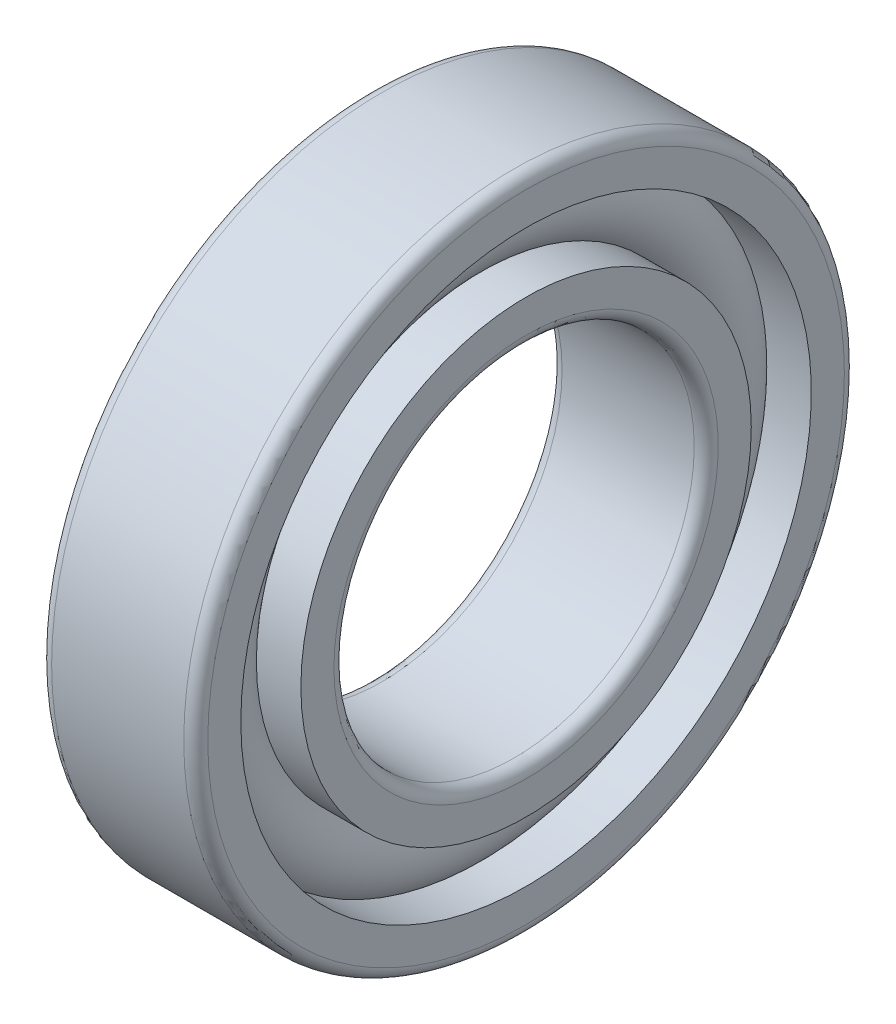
ISO-10303-21;
HEADER;
FILE_DESCRIPTION(('STEP AP214'),'2;1');
FILE_NAME('part.step','',(''),(''),'','','');
FILE_SCHEMA(('AUTOMOTIVE_DESIGN { 1 0 10303 214 1 1 1 1 }'));
ENDSEC;
DATA;
#1=APPLICATION_CONTEXT('core data for automotive mechanical design processes');
#2=APPLICATION_PROTOCOL_DEFINITION('international standard','automotive_design',2000,#1);
#3=PRODUCT_CONTEXT('',#1,'mechanical');
#4=PRODUCT('Part','Part','',(#3));
#5=PRODUCT_RELATED_PRODUCT_CATEGORY('part','',(#4));
#6=PRODUCT_DEFINITION_FORMATION('','',#4);
#7=PRODUCT_DEFINITION_CONTEXT('part definition',#1,'design');
#8=PRODUCT_DEFINITION('design','',#6,#7);
#9=PRODUCT_DEFINITION_SHAPE('','',#8);
#10=(LENGTH_UNIT() NAMED_UNIT(*) SI_UNIT(.MILLI.,.METRE.));
#11=(NAMED_UNIT(*) PLANE_ANGLE_UNIT() SI_UNIT($,.RADIAN.));
#12=(NAMED_UNIT(*) SI_UNIT($,.STERADIAN.) SOLID_ANGLE_UNIT());
#13=UNCERTAINTY_MEASURE_WITH_UNIT(LENGTH_MEASURE(1.E-05),#10,'distance_accuracy_value','');
#14=(GEOMETRIC_REPRESENTATION_CONTEXT(3) GLOBAL_UNCERTAINTY_ASSIGNED_CONTEXT((#13)) GLOBAL_UNIT_ASSIGNED_CONTEXT((#10,
#11,#12)) REPRESENTATION_CONTEXT('',''));
#15=CARTESIAN_POINT('',(0.,0.,0.));
#16=DIRECTION('',(0.,0.,1.));
#17=DIRECTION('',(1.,0.,0.));
#18=AXIS2_PLACEMENT_3D('',#15,#16,#17);
#19=CARTESIAN_POINT('',(6.5,0.,0.));
#20=DIRECTION('',(-1.,0.,0.));
#21=DIRECTION('',(0.,0.,1.));
#22=AXIS2_PLACEMENT_3D('',#19,#20,#21);
#23=TOROIDAL_SURFACE('',#22,21.25,3.75);
#24=CARTESIAN_POINT('',(6.5,0.,25.));
#25=VERTEX_POINT('',#24);
#26=VERTEX_LOOP('',#25);
#27=FACE_BOUND('',#26,.T.);
#28=ADVANCED_FACE('P0_F36',(#27),#23,.T.);
#29=CLOSED_SHELL('',(#28));
#30=CARTESIAN_POINT('',(6.5,0.,0.));
#31=DIRECTION('',(-1.,0.,0.));
#32=DIRECTION('',(0.,0.,1.));
#33=AXIS2_PLACEMENT_3D('',#30,#31,#32);
#34=TOROIDAL_SURFACE('',#33,21.25,3.7);
#35=CARTESIAN_POINT('',(6.5,0.,24.95));
#36=VERTEX_POINT('',#35);
#37=VERTEX_LOOP('',#36);
#38=FACE_BOUND('',#37,.T.);
#39=ADVANCED_FACE('P0_F49',(#38),#34,.F.);
#40=CLOSED_SHELL('',(#39));
#41=ORIENTED_CLOSED_SHELL('',*,#40,.T.);
#42=BREP_WITH_VOIDS('P0_B2',#29,(#41));
#43=CARTESIAN_POINT('',(0.499999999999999,23.65,0.));
#44=DIRECTION('',(1.,0.,0.));
#45=DIRECTION('',(0.,0.,-1.));
#46=AXIS2_PLACEMENT_3D('',#43,#44,#45);
#47=PLANE('',#46);
#48=CARTESIAN_POINT('',(0.499999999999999,0.,0.));
#49=DIRECTION('',(-1.,0.,0.));
#50=DIRECTION('',(0.,0.,1.));
#51=AXIS2_PLACEMENT_3D('',#48,#49,#50);
#52=CIRCLE('',#51,18.85);
#53=CARTESIAN_POINT('',(0.499999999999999,0.,18.85));
#54=VERTEX_POINT('',#53);
#55=EDGE_CURVE('P0_E34',#54,#54,#52,.T.);
#56=ORIENTED_EDGE('',*,*,#55,.F.);
#57=EDGE_LOOP('',(#56));
#58=FACE_BOUND('',#57,.T.);
#59=CARTESIAN_POINT('',(0.499999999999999,0.,0.));
#60=DIRECTION('',(-1.,0.,0.));
#61=DIRECTION('',(0.,0.,1.));
#62=AXIS2_PLACEMENT_3D('',#59,#60,#61);
#63=CIRCLE('',#62,23.65);
#64=CARTESIAN_POINT('',(0.499999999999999,0.,23.65));
#65=VERTEX_POINT('',#64);
#66=EDGE_CURVE('P0_E80',#65,#65,#63,.T.);
#67=ORIENTED_EDGE('',*,*,#66,.T.);
#68=EDGE_LOOP('',(#67));
#69=FACE_BOUND('',#68,.T.);
#70=ADVANCED_FACE('P0_F66',(#58,#69),#47,.F.);
#71=CARTESIAN_POINT('',(0.,0.,0.));
#72=DIRECTION('',(-1.,0.,0.));
#73=DIRECTION('',(0.,0.,1.));
#74=AXIS2_PLACEMENT_3D('',#71,#72,#73);
#75=CYLINDRICAL_SURFACE('',#74,18.85);
#76=CARTESIAN_POINT('',(0.699999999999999,0.,0.));
#77=DIRECTION('',(-1.,0.,0.));
#78=DIRECTION('',(0.,0.,1.));
#79=AXIS2_PLACEMENT_3D('',#76,#77,#78);
#80=CIRCLE('',#79,18.85);
#81=CARTESIAN_POINT('',(0.699999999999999,0.,18.85));
#82=VERTEX_POINT('',#81);
#83=EDGE_CURVE('P0_E72',#82,#82,#80,.T.);
#84=ORIENTED_EDGE('',*,*,#83,.F.);
#85=EDGE_LOOP('',(#84));
#86=FACE_BOUND('',#85,.T.);
#87=ORIENTED_EDGE('',*,*,#55,.T.);
#88=EDGE_LOOP('',(#87));
#89=FACE_BOUND('',#88,.T.);
#90=ADVANCED_FACE('P0_F95',(#86,#89),#75,.F.);
#91=CARTESIAN_POINT('',(0.699999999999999,23.65,0.));
#92=DIRECTION('',(-1.,0.,0.));
#93=DIRECTION('',(0.,0.,1.));
#94=AXIS2_PLACEMENT_3D('',#91,#92,#93);
#95=PLANE('',#94);
#96=CARTESIAN_POINT('',(0.699999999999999,0.,0.));
#97=DIRECTION('',(-1.,0.,0.));
#98=DIRECTION('',(0.,0.,1.));
#99=AXIS2_PLACEMENT_3D('',#96,#97,#98);
#100=CIRCLE('',#99,23.65);
#101=CARTESIAN_POINT('',(0.699999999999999,0.,23.65));
#102=VERTEX_POINT('',#101);
#103=EDGE_CURVE('P0_E76',#102,#102,#100,.T.);
#104=ORIENTED_EDGE('',*,*,#103,.F.);
#105=EDGE_LOOP('',(#104));
#106=FACE_BOUND('',#105,.T.);
#107=ORIENTED_EDGE('',*,*,#83,.T.);
#108=EDGE_LOOP('',(#107));
#109=FACE_BOUND('',#108,.T.);
#110=ADVANCED_FACE('P0_F90',(#106,#109),#95,.F.);
#111=CARTESIAN_POINT('',(0.,0.,0.));
#112=DIRECTION('',(-1.,0.,0.));
#113=DIRECTION('',(0.,0.,1.));
#114=AXIS2_PLACEMENT_3D('',#111,#112,#113);
#115=CYLINDRICAL_SURFACE('',#114,23.65);
#116=ORIENTED_EDGE('',*,*,#66,.F.);
#117=EDGE_LOOP('',(#116));
#118=FACE_BOUND('',#117,.T.);
#119=ORIENTED_EDGE('',*,*,#103,.T.);
#120=EDGE_LOOP('',(#119));
#121=FACE_BOUND('',#120,.T.);
#122=ADVANCED_FACE('P0_F87',(#118,#121),#115,.T.);
#123=CLOSED_SHELL('',(#70,#90,#110,#122));
#124=MANIFOLD_SOLID_BREP('P0_B6',#123);
#125=CARTESIAN_POINT('',(1.,0.,0.));
#126=DIRECTION('',(-1.,0.,0.));
#127=DIRECTION('',(0.,0.,1.));
#128=AXIS2_PLACEMENT_3D('',#125,#126,#127);
#129=TOROIDAL_SURFACE('',#128,16.,1.);
#130=CARTESIAN_POINT('',(1.,0.,0.));
#131=DIRECTION('',(-1.,0.,0.));
#132=DIRECTION('',(0.,0.,1.));
#133=AXIS2_PLACEMENT_3D('',#130,#131,#132);
#134=CIRCLE('',#133,15.);
#135=CARTESIAN_POINT('',(1.,0.,15.));
#136=VERTEX_POINT('',#135);
#137=EDGE_CURVE('P0_E65',#136,#136,#134,.T.);
#138=ORIENTED_EDGE('',*,*,#137,.F.);
#139=EDGE_LOOP('',(#138));
#140=FACE_BOUND('',#139,.T.);
#141=CARTESIAN_POINT('',(0.,0.,0.));
#142=DIRECTION('',(-1.,0.,0.));
#143=DIRECTION('',(0.,0.,1.));
#144=AXIS2_PLACEMENT_3D('',#141,#142,#143);
#145=CIRCLE('',#144,16.);
#146=CARTESIAN_POINT('',(0.,0.,16.));
#147=VERTEX_POINT('',#146);
#148=EDGE_CURVE('P0_E155',#147,#147,#145,.T.);
#149=ORIENTED_EDGE('',*,*,#148,.T.);
#150=EDGE_LOOP('',(#149));
#151=FACE_BOUND('',#150,.T.);
#152=ADVANCED_FACE('P0_F127',(#140,#151),#129,.T.);
#153=CARTESIAN_POINT('',(0.,0.,0.));
#154=DIRECTION('',(-1.,0.,0.));
#155=DIRECTION('',(0.,0.,1.));
#156=AXIS2_PLACEMENT_3D('',#153,#154,#155);
#157=CYLINDRICAL_SURFACE('',#156,15.);
#158=CARTESIAN_POINT('',(12.,0.,0.));
#159=DIRECTION('',(-1.,0.,0.));
#160=DIRECTION('',(0.,0.,1.));
#161=AXIS2_PLACEMENT_3D('',#158,#159,#160);
#162=CIRCLE('',#161,15.);
#163=CARTESIAN_POINT('',(12.,0.,15.));
#164=VERTEX_POINT('',#163);
#165=EDGE_CURVE('P0_E133',#164,#164,#162,.T.);
#166=ORIENTED_EDGE('',*,*,#165,.F.);
#167=EDGE_LOOP('',(#166));
#168=FACE_BOUND('',#167,.T.);
#169=ORIENTED_EDGE('',*,*,#137,.T.);
#170=EDGE_LOOP('',(#169));
#171=FACE_BOUND('',#170,.T.);
#172=ADVANCED_FACE('P0_F192',(#168,#171),#157,.F.);
#173=CARTESIAN_POINT('',(12.,0.,0.));
#174=DIRECTION('',(-1.,0.,0.));
#175=DIRECTION('',(0.,0.,1.));
#176=AXIS2_PLACEMENT_3D('',#173,#174,#175);
#177=TOROIDAL_SURFACE('',#176,16.,1.);
#178=CARTESIAN_POINT('',(13.,0.,0.));
#179=DIRECTION('',(-1.,0.,0.));
#180=DIRECTION('',(0.,0.,1.));
#181=AXIS2_PLACEMENT_3D('',#178,#179,#180);
#182=CIRCLE('',#181,16.);
#183=CARTESIAN_POINT('',(13.,0.,16.));
#184=VERTEX_POINT('',#183);
#185=EDGE_CURVE('P0_E137',#184,#184,#182,.T.);
#186=ORIENTED_EDGE('',*,*,#185,.F.);
#187=EDGE_LOOP('',(#186));
#188=FACE_BOUND('',#187,.T.);
#189=ORIENTED_EDGE('',*,*,#165,.T.);
#190=EDGE_LOOP('',(#189));
#191=FACE_BOUND('',#190,.T.);
#192=ADVANCED_FACE('P0_F187',(#188,#191),#177,.T.);
#193=CARTESIAN_POINT('',(13.,0.,-18.75));
#194=DIRECTION('',(-1.,0.,0.));
#195=DIRECTION('',(0.,0.,1.));
#196=AXIS2_PLACEMENT_3D('',#193,#194,#195);
#197=PLANE('',#196);
#198=CARTESIAN_POINT('',(13.,0.,0.));
#199=DIRECTION('',(-1.,0.,0.));
#200=DIRECTION('',(0.,0.,1.));
#201=AXIS2_PLACEMENT_3D('',#198,#199,#200);
#202=CIRCLE('',#201,18.75);
#203=CARTESIAN_POINT('',(13.,0.,18.75));
#204=VERTEX_POINT('',#203);
#205=EDGE_CURVE('P0_E141',#204,#204,#202,.T.);
#206=ORIENTED_EDGE('',*,*,#205,.F.);
#207=EDGE_LOOP('',(#206));
#208=FACE_BOUND('',#207,.T.);
#209=ORIENTED_EDGE('',*,*,#185,.T.);
#210=EDGE_LOOP('',(#209));
#211=FACE_BOUND('',#210,.T.);
#212=ADVANCED_FACE('P0_F181',(#208,#211),#197,.F.);
#213=CARTESIAN_POINT('',(0.,0.,0.));
#214=DIRECTION('',(-1.,0.,0.));
#215=DIRECTION('',(0.,0.,1.));
#216=AXIS2_PLACEMENT_3D('',#213,#214,#215);
#217=CYLINDRICAL_SURFACE('',#216,18.75);
#218=CARTESIAN_POINT('',(9.29508497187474,0.,0.));
#219=DIRECTION('',(-1.,0.,0.));
#220=DIRECTION('',(0.,0.,1.));
#221=AXIS2_PLACEMENT_3D('',#218,#219,#220);
#222=CIRCLE('',#221,18.75);
#223=CARTESIAN_POINT('',(9.29508497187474,0.,18.75));
#224=VERTEX_POINT('',#223);
#225=EDGE_CURVE('P0_E146',#224,#224,#222,.T.);
#226=ORIENTED_EDGE('',*,*,#225,.F.);
#227=EDGE_LOOP('',(#226));
#228=FACE_BOUND('',#227,.T.);
#229=ORIENTED_EDGE('',*,*,#205,.T.);
#230=EDGE_LOOP('',(#229));
#231=FACE_BOUND('',#230,.T.);
#232=ADVANCED_FACE('P0_F175',(#228,#231),#217,.T.);
#233=CARTESIAN_POINT('',(6.5,0.,0.));
#234=DIRECTION('',(-1.,0.,0.));
#235=DIRECTION('',(0.,0.,1.));
#236=AXIS2_PLACEMENT_3D('',#233,#234,#235);
#237=TOROIDAL_SURFACE('',#236,21.25,3.75);
#238=CARTESIAN_POINT('',(3.70491502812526,0.,0.));
#239=DIRECTION('',(-1.,0.,0.));
#240=DIRECTION('',(0.,0.,1.));
#241=AXIS2_PLACEMENT_3D('',#238,#239,#240);
#242=CIRCLE('',#241,18.75);
#243=CARTESIAN_POINT('',(3.70491502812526,0.,18.75));
#244=VERTEX_POINT('',#243);
#245=EDGE_CURVE('P0_E149',#244,#244,#242,.T.);
#246=ORIENTED_EDGE('',*,*,#245,.F.);
#247=EDGE_LOOP('',(#246));
#248=FACE_BOUND('',#247,.T.);
#249=ORIENTED_EDGE('',*,*,#225,.T.);
#250=EDGE_LOOP('',(#249));
#251=FACE_BOUND('',#250,.T.);
#252=ADVANCED_FACE('P0_F169',(#248,#251),#237,.F.);
#253=CARTESIAN_POINT('',(0.,0.,0.));
#254=DIRECTION('',(-1.,0.,0.));
#255=DIRECTION('',(0.,0.,1.));
#256=AXIS2_PLACEMENT_3D('',#253,#254,#255);
#257=CYLINDRICAL_SURFACE('',#256,18.75);
#258=CARTESIAN_POINT('',(0.,0.,0.));
#259=DIRECTION('',(-1.,0.,0.));
#260=DIRECTION('',(0.,0.,1.));
#261=AXIS2_PLACEMENT_3D('',#258,#259,#260);
#262=CIRCLE('',#261,18.75);
#263=CARTESIAN_POINT('',(0.,0.,18.75));
#264=VERTEX_POINT('',#263);
#265=EDGE_CURVE('P0_E152',#264,#264,#262,.T.);
#266=ORIENTED_EDGE('',*,*,#265,.F.);
#267=EDGE_LOOP('',(#266));
#268=FACE_BOUND('',#267,.T.);
#269=ORIENTED_EDGE('',*,*,#245,.T.);
#270=EDGE_LOOP('',(#269));
#271=FACE_BOUND('',#270,.T.);
#272=ADVANCED_FACE('P0_F163',(#268,#271),#257,.T.);
#273=CARTESIAN_POINT('',(0.,0.,-18.75));
#274=DIRECTION('',(1.,0.,0.));
#275=DIRECTION('',(0.,0.,-1.));
#276=AXIS2_PLACEMENT_3D('',#273,#274,#275);
#277=PLANE('',#276);
#278=ORIENTED_EDGE('',*,*,#148,.F.);
#279=EDGE_LOOP('',(#278));
#280=FACE_BOUND('',#279,.T.);
#281=ORIENTED_EDGE('',*,*,#265,.T.);
#282=EDGE_LOOP('',(#281));
#283=FACE_BOUND('',#282,.T.);
#284=ADVANCED_FACE('P0_F160',(#280,#283),#277,.F.);
#285=CLOSED_SHELL('',(#152,#172,#192,#212,#232,#252,#272,#284));
#286=MANIFOLD_SOLID_BREP('P0_B29',#285);
#287=CARTESIAN_POINT('',(0.999999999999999,0.,0.));
#288=DIRECTION('',(-1.,0.,0.));
#289=DIRECTION('',(0.,0.,1.));
#290=AXIS2_PLACEMENT_3D('',#287,#288,#289);
#291=TOROIDAL_SURFACE('',#290,26.5,1.);
#292=CARTESIAN_POINT('',(0.,0.,0.));
#293=DIRECTION('',(-1.,0.,0.));
#294=DIRECTION('',(0.,0.,1.));
#295=AXIS2_PLACEMENT_3D('',#292,#293,#294);
#296=CIRCLE('',#295,26.5);
#297=CARTESIAN_POINT('',(0.,0.,26.5));
#298=VERTEX_POINT('',#297);
#299=EDGE_CURVE('P1_E10',#298,#298,#296,.T.);
#300=ORIENTED_EDGE('',*,*,#299,.F.);
#301=EDGE_LOOP('',(#300));
#302=FACE_BOUND('',#301,.T.);
#303=CARTESIAN_POINT('',(0.999999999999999,0.,0.));
#304=DIRECTION('',(-1.,0.,0.));
#305=DIRECTION('',(0.,0.,1.));
#306=AXIS2_PLACEMENT_3D('',#303,#304,#305);
#307=CIRCLE('',#306,27.5);
#308=CARTESIAN_POINT('',(0.999999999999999,0.,27.5));
#309=VERTEX_POINT('',#308);
#310=EDGE_CURVE('P1_E42',#309,#309,#307,.T.);
#311=ORIENTED_EDGE('',*,*,#310,.T.);
#312=EDGE_LOOP('',(#311));
#313=FACE_BOUND('',#312,.T.);
#314=ADVANCED_FACE('P1_F14',(#302,#313),#291,.T.);
#315=CARTESIAN_POINT('',(0.,0.,-26.5));
#316=DIRECTION('',(1.,0.,0.));
#317=DIRECTION('',(0.,0.,-1.));
#318=AXIS2_PLACEMENT_3D('',#315,#316,#317);
#319=PLANE('',#318);
#320=CARTESIAN_POINT('',(0.,0.,0.));
#321=DIRECTION('',(-1.,0.,0.));
#322=DIRECTION('',(0.,0.,1.));
#323=AXIS2_PLACEMENT_3D('',#320,#321,#322);
#324=CIRCLE('',#323,23.75);
#325=CARTESIAN_POINT('',(0.,0.,23.75));
#326=VERTEX_POINT('',#325);
#327=EDGE_CURVE('P1_E20',#326,#326,#324,.T.);
#328=ORIENTED_EDGE('',*,*,#327,.F.);
#329=EDGE_LOOP('',(#328));
#330=FACE_BOUND('',#329,.T.);
#331=ORIENTED_EDGE('',*,*,#299,.T.);
#332=EDGE_LOOP('',(#331));
#333=FACE_BOUND('',#332,.T.);
#334=ADVANCED_FACE('P1_F79',(#330,#333),#319,.F.);
#335=CARTESIAN_POINT('',(0.,0.,0.));
#336=DIRECTION('',(-1.,0.,0.));
#337=DIRECTION('',(0.,0.,1.));
#338=AXIS2_PLACEMENT_3D('',#335,#336,#337);
#339=CYLINDRICAL_SURFACE('',#338,23.75);
#340=CARTESIAN_POINT('',(3.70491502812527,0.,0.));
#341=DIRECTION('',(-1.,0.,0.));
#342=DIRECTION('',(0.,0.,1.));
#343=AXIS2_PLACEMENT_3D('',#340,#341,#342);
#344=CIRCLE('',#343,23.75);
#345=CARTESIAN_POINT('',(3.70491502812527,0.,23.75));
#346=VERTEX_POINT('',#345);
#347=EDGE_CURVE('P1_E24',#346,#346,#344,.T.);
#348=ORIENTED_EDGE('',*,*,#347,.F.);
#349=EDGE_LOOP('',(#348));
#350=FACE_BOUND('',#349,.T.);
#351=ORIENTED_EDGE('',*,*,#327,.T.);
#352=EDGE_LOOP('',(#351));
#353=FACE_BOUND('',#352,.T.);
#354=ADVANCED_FACE('P1_F74',(#350,#353),#339,.F.);
#355=CARTESIAN_POINT('',(6.5,0.,0.));
#356=DIRECTION('',(-1.,0.,0.));
#357=DIRECTION('',(0.,0.,1.));
#358=AXIS2_PLACEMENT_3D('',#355,#356,#357);
#359=TOROIDAL_SURFACE('',#358,21.25,3.75);
#360=CARTESIAN_POINT('',(9.29508497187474,0.,0.));
#361=DIRECTION('',(-1.,0.,0.));
#362=DIRECTION('',(0.,0.,1.));
#363=AXIS2_PLACEMENT_3D('',#360,#361,#362);
#364=CIRCLE('',#363,23.75);
#365=CARTESIAN_POINT('',(9.29508497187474,0.,23.75));
#366=VERTEX_POINT('',#365);
#367=EDGE_CURVE('P1_E28',#366,#366,#364,.T.);
#368=ORIENTED_EDGE('',*,*,#367,.F.);
#369=EDGE_LOOP('',(#368));
#370=FACE_BOUND('',#369,.T.);
#371=ORIENTED_EDGE('',*,*,#347,.T.);
#372=EDGE_LOOP('',(#371));
#373=FACE_BOUND('',#372,.T.);
#374=ADVANCED_FACE('P1_F68',(#370,#373),#359,.F.);
#375=CARTESIAN_POINT('',(0.,0.,0.));
#376=DIRECTION('',(-1.,0.,0.));
#377=DIRECTION('',(0.,0.,1.));
#378=AXIS2_PLACEMENT_3D('',#375,#376,#377);
#379=CYLINDRICAL_SURFACE('',#378,23.75);
#380=CARTESIAN_POINT('',(13.,0.,0.));
#381=DIRECTION('',(-1.,0.,0.));
#382=DIRECTION('',(0.,0.,1.));
#383=AXIS2_PLACEMENT_3D('',#380,#381,#382);
#384=CIRCLE('',#383,23.75);
#385=CARTESIAN_POINT('',(13.,0.,23.75));
#386=VERTEX_POINT('',#385);
#387=EDGE_CURVE('P1_E33',#386,#386,#384,.T.);
#388=ORIENTED_EDGE('',*,*,#387,.F.);
#389=EDGE_LOOP('',(#388));
#390=FACE_BOUND('',#389,.T.);
#391=ORIENTED_EDGE('',*,*,#367,.T.);
#392=EDGE_LOOP('',(#391));
#393=FACE_BOUND('',#392,.T.);
#394=ADVANCED_FACE('P1_F62',(#390,#393),#379,.F.);
#395=CARTESIAN_POINT('',(13.,0.,-26.5));
#396=DIRECTION('',(-1.,0.,0.));
#397=DIRECTION('',(0.,0.,1.));
#398=AXIS2_PLACEMENT_3D('',#395,#396,#397);
#399=PLANE('',#398);
#400=CARTESIAN_POINT('',(13.,0.,0.));
#401=DIRECTION('',(-1.,0.,0.));
#402=DIRECTION('',(0.,0.,1.));
#403=AXIS2_PLACEMENT_3D('',#400,#401,#402);
#404=CIRCLE('',#403,26.5);
#405=CARTESIAN_POINT('',(13.,0.,26.5));
#406=VERTEX_POINT('',#405);
#407=EDGE_CURVE('P1_E36',#406,#406,#404,.T.);
#408=ORIENTED_EDGE('',*,*,#407,.F.);
#409=EDGE_LOOP('',(#408));
#410=FACE_BOUND('',#409,.T.);
#411=ORIENTED_EDGE('',*,*,#387,.T.);
#412=EDGE_LOOP('',(#411));
#413=FACE_BOUND('',#412,.T.);
#414=ADVANCED_FACE('P1_F56',(#410,#413),#399,.F.);
#415=CARTESIAN_POINT('',(12.,0.,0.));
#416=DIRECTION('',(-1.,0.,0.));
#417=DIRECTION('',(0.,0.,1.));
#418=AXIS2_PLACEMENT_3D('',#415,#416,#417);
#419=TOROIDAL_SURFACE('',#418,26.5,1.);
#420=CARTESIAN_POINT('',(12.,0.,0.));
#421=DIRECTION('',(-1.,0.,0.));
#422=DIRECTION('',(0.,0.,1.));
#423=AXIS2_PLACEMENT_3D('',#420,#421,#422);
#424=CIRCLE('',#423,27.5);
#425=CARTESIAN_POINT('',(12.,0.,27.5));
#426=VERTEX_POINT('',#425);
#427=EDGE_CURVE('P1_E39',#426,#426,#424,.T.);
#428=ORIENTED_EDGE('',*,*,#427,.F.);
#429=EDGE_LOOP('',(#428));
#430=FACE_BOUND('',#429,.T.);
#431=ORIENTED_EDGE('',*,*,#407,.T.);
#432=EDGE_LOOP('',(#431));
#433=FACE_BOUND('',#432,.T.);
#434=ADVANCED_FACE('P1_F50',(#430,#433),#419,.T.);
#435=CARTESIAN_POINT('',(0.,0.,0.));
#436=DIRECTION('',(-1.,0.,0.));
#437=DIRECTION('',(0.,0.,1.));
#438=AXIS2_PLACEMENT_3D('',#435,#436,#437);
#439=CYLINDRICAL_SURFACE('',#438,27.5);
#440=ORIENTED_EDGE('',*,*,#310,.F.);
#441=EDGE_LOOP('',(#440));
#442=FACE_BOUND('',#441,.T.);
#443=ORIENTED_EDGE('',*,*,#427,.T.);
#444=EDGE_LOOP('',(#443));
#445=FACE_BOUND('',#444,.T.);
#446=ADVANCED_FACE('P1_F47',(#442,#445),#439,.T.);
#447=CLOSED_SHELL('',(#314,#334,#354,#374,#394,#414,#434,#446));
#448=MANIFOLD_SOLID_BREP('P1_B1',#447);
#449=ADVANCED_BREP_SHAPE_REPRESENTATION('',(#18,#42,#124,#286,#448),#14);
#450=SHAPE_DEFINITION_REPRESENTATION(#9,#449);
ENDSEC;
END-ISO-10303-21;
